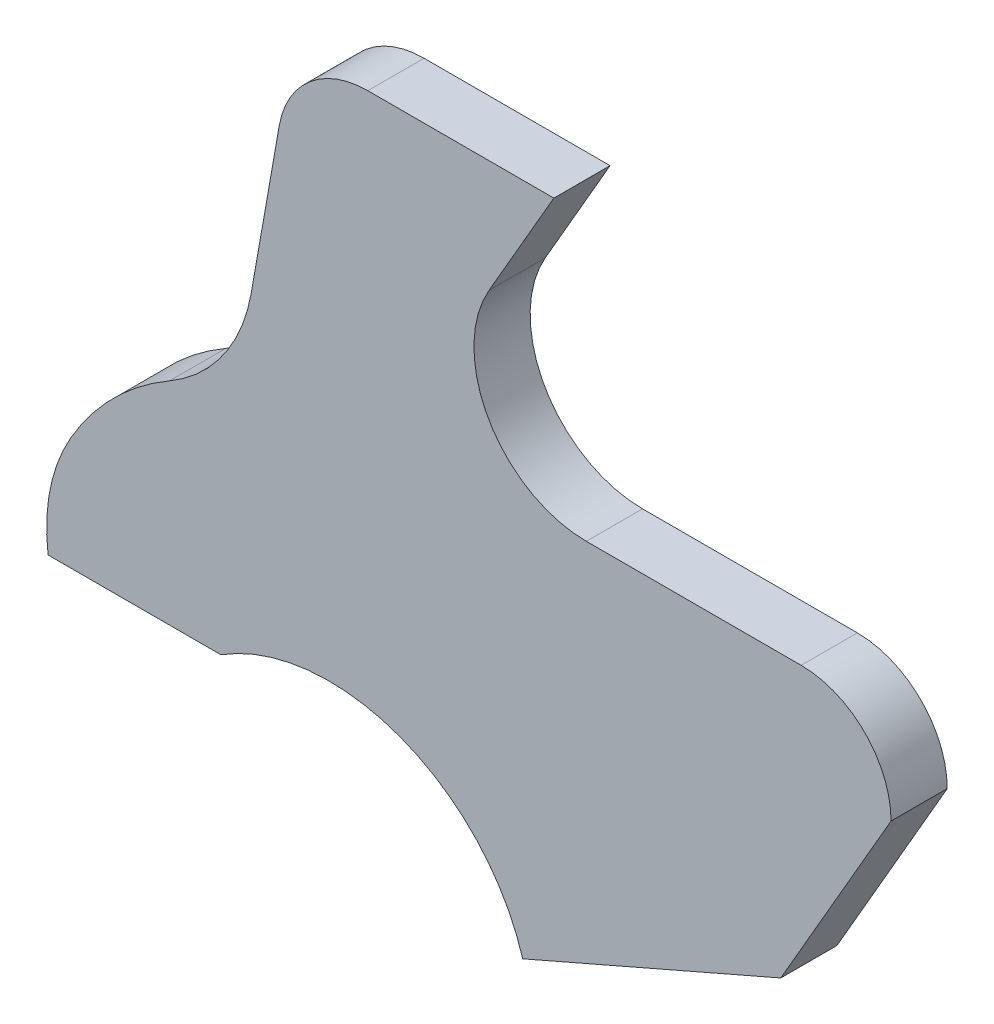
from build123d import *

# Parameters (mm, degrees)
BOSS_EXTRU_1_DEPTH = 10


with BuildPart() as part:
    # Esquisse1 → Boss.-Extru.1 (new body)
    with BuildSketch(Plane.XY):
        with BuildLine():
            Line((0, 0), (-30.744227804, 0))
            ThreePointArc((-30.744227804, 0), (-30.377607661, 10.363317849), (-26.716315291, 20.06526123))
            ThreePointArc((-26.716315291, 20.06526123), (-19.088221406, 30.006386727), (-9.147095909, 37.634480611))
            ThreePointArc((-9.147095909, 37.634480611), (0.42746542, 46.407949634), (5.397136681, 58.405797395))
            Line((5.397136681, 58.405797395), (10.399986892, 86.778370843))
            ThreePointArc((10.399986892, 86.778370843), (15.872309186, 96.25671109), (26.156910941, 100))
            Line((26.156910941, 100), (59.255772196, 100))
            Line((59.255772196, 100), (47.708766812, 80))
            ThreePointArc((47.708766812, 80), (47.708766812, 60), (65.029274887, 50))
            Line((65.029274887, 50), (103.255772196, 50))
            ThreePointArc((103.255772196, 50), (114.569480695, 45.313708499), (119.255772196, 34))
            Line((119.255772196, 34), (99.625863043, 0))
            Line((99.625863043, 0), (53.715586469, -20))
            ThreePointArc((53.715586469, -20), (31.81724997, 3.320006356), (0, 0))
        make_face()
    extrude(amount=BOSS_EXTRU_1_DEPTH)


solid = part.part
